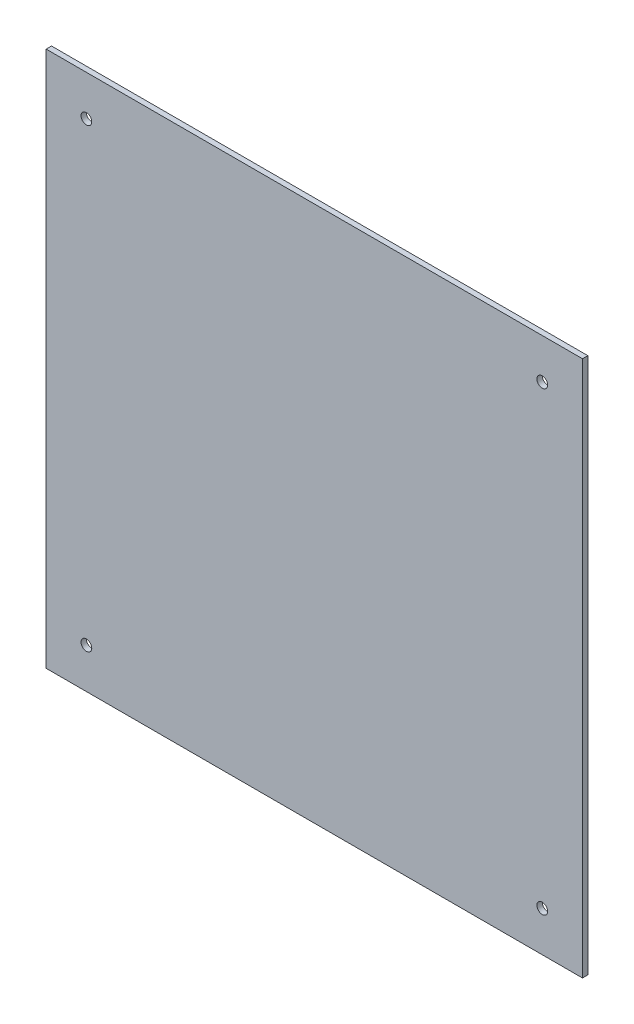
ISO-10303-21;
HEADER;
FILE_DESCRIPTION(('STEP AP214'),'2;1');
FILE_NAME('part.step','',(''),(''),'','','');
FILE_SCHEMA(('AUTOMOTIVE_DESIGN { 1 0 10303 214 1 1 1 1 }'));
ENDSEC;
DATA;
#1=APPLICATION_CONTEXT('core data for automotive mechanical design processes');
#2=APPLICATION_PROTOCOL_DEFINITION('international standard','automotive_design',2000,#1);
#3=PRODUCT_CONTEXT('',#1,'mechanical');
#4=PRODUCT('Part','Part','',(#3));
#5=PRODUCT_RELATED_PRODUCT_CATEGORY('part','',(#4));
#6=PRODUCT_DEFINITION_FORMATION('','',#4);
#7=PRODUCT_DEFINITION_CONTEXT('part definition',#1,'design');
#8=PRODUCT_DEFINITION('design','',#6,#7);
#9=PRODUCT_DEFINITION_SHAPE('','',#8);
#10=(LENGTH_UNIT() NAMED_UNIT(*) SI_UNIT(.MILLI.,.METRE.));
#11=(NAMED_UNIT(*) PLANE_ANGLE_UNIT() SI_UNIT($,.RADIAN.));
#12=(NAMED_UNIT(*) SI_UNIT($,.STERADIAN.) SOLID_ANGLE_UNIT());
#13=UNCERTAINTY_MEASURE_WITH_UNIT(LENGTH_MEASURE(1.E-05),#10,'distance_accuracy_value','');
#14=(GEOMETRIC_REPRESENTATION_CONTEXT(3) GLOBAL_UNCERTAINTY_ASSIGNED_CONTEXT((#13)) GLOBAL_UNIT_ASSIGNED_CONTEXT((#10,
#11,#12)) REPRESENTATION_CONTEXT('',''));
#15=CARTESIAN_POINT('',(0.,0.,0.));
#16=DIRECTION('',(0.,0.,1.));
#17=DIRECTION('',(1.,0.,0.));
#18=AXIS2_PLACEMENT_3D('',#15,#16,#17);
#19=CARTESIAN_POINT('',(0.,0.,2.));
#20=DIRECTION('',(0.,0.,-1.));
#21=DIRECTION('',(-1.,0.,0.));
#22=AXIS2_PLACEMENT_3D('',#19,#20,#21);
#23=PLANE('',#22);
#24=CARTESIAN_POINT('',(185.,-185.,2.));
#25=DIRECTION('',(0.,0.,1.));
#26=DIRECTION('',(1.,0.,0.));
#27=AXIS2_PLACEMENT_3D('',#24,#25,#26);
#28=CIRCLE('',#27,2.);
#29=CARTESIAN_POINT('',(187.,-185.,2.));
#30=VERTEX_POINT('',#29);
#31=EDGE_CURVE('E118',#30,#30,#28,.T.);
#32=ORIENTED_EDGE('',*,*,#31,.F.);
#33=EDGE_LOOP('',(#32));
#34=FACE_BOUND('',#33,.T.);
#35=CARTESIAN_POINT('',(15.,-15.,2.));
#36=DIRECTION('',(0.,0.,1.));
#37=DIRECTION('',(1.,0.,0.));
#38=AXIS2_PLACEMENT_3D('',#35,#36,#37);
#39=CIRCLE('',#38,2.00000000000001);
#40=CARTESIAN_POINT('',(17.,-15.,2.));
#41=VERTEX_POINT('',#40);
#42=EDGE_CURVE('E97',#41,#41,#39,.T.);
#43=ORIENTED_EDGE('',*,*,#42,.F.);
#44=EDGE_LOOP('',(#43));
#45=FACE_BOUND('',#44,.T.);
#46=DIRECTION('',(0.,-1.,0.));
#47=VECTOR('',#46,1.);
#48=CARTESIAN_POINT('',(0.,-200.,2.));
#49=LINE('',#48,#47);
#50=CARTESIAN_POINT('',(0.,0.,2.));
#51=VERTEX_POINT('',#50);
#52=CARTESIAN_POINT('',(0.,-200.,2.));
#53=VERTEX_POINT('',#52);
#54=EDGE_CURVE('E82',#51,#53,#49,.T.);
#55=ORIENTED_EDGE('',*,*,#54,.T.);
#56=DIRECTION('',(1.,0.,0.));
#57=VECTOR('',#56,1.);
#58=CARTESIAN_POINT('',(200.,-200.,2.));
#59=LINE('',#58,#57);
#60=CARTESIAN_POINT('',(200.,-200.,2.));
#61=VERTEX_POINT('',#60);
#62=EDGE_CURVE('E77',#53,#61,#59,.T.);
#63=ORIENTED_EDGE('',*,*,#62,.T.);
#64=DIRECTION('',(0.,1.,0.));
#65=VECTOR('',#64,1.);
#66=CARTESIAN_POINT('',(200.,0.,2.));
#67=LINE('',#66,#65);
#68=CARTESIAN_POINT('',(200.,0.,2.));
#69=VERTEX_POINT('',#68);
#70=EDGE_CURVE('E80',#61,#69,#67,.T.);
#71=ORIENTED_EDGE('',*,*,#70,.T.);
#72=DIRECTION('',(-1.,0.,0.));
#73=VECTOR('',#72,1.);
#74=CARTESIAN_POINT('',(0.,0.,2.));
#75=LINE('',#74,#73);
#76=EDGE_CURVE('E47',#69,#51,#75,.T.);
#77=ORIENTED_EDGE('',*,*,#76,.T.);
#78=EDGE_LOOP('',(#55,#63,#71,#77));
#79=FACE_BOUND('',#78,.T.);
#80=CARTESIAN_POINT('',(185.,-15.,2.));
#81=DIRECTION('',(0.,0.,1.));
#82=DIRECTION('',(1.,0.,0.));
#83=AXIS2_PLACEMENT_3D('',#80,#81,#82);
#84=CIRCLE('',#83,2.);
#85=CARTESIAN_POINT('',(187.,-15.,2.));
#86=VERTEX_POINT('',#85);
#87=EDGE_CURVE('E112',#86,#86,#84,.T.);
#88=ORIENTED_EDGE('',*,*,#87,.F.);
#89=EDGE_LOOP('',(#88));
#90=FACE_BOUND('',#89,.T.);
#91=CARTESIAN_POINT('',(15.,-185.,2.));
#92=DIRECTION('',(0.,0.,1.));
#93=DIRECTION('',(1.,0.,0.));
#94=AXIS2_PLACEMENT_3D('',#91,#92,#93);
#95=CIRCLE('',#94,2.);
#96=CARTESIAN_POINT('',(17.,-185.,2.));
#97=VERTEX_POINT('',#96);
#98=EDGE_CURVE('E124',#97,#97,#95,.T.);
#99=ORIENTED_EDGE('',*,*,#98,.F.);
#100=EDGE_LOOP('',(#99));
#101=FACE_BOUND('',#100,.T.);
#102=ADVANCED_FACE('F30',(#34,#45,#79,#90,#101),#23,.F.);
#103=CARTESIAN_POINT('',(0.,0.,0.));
#104=DIRECTION('',(0.,0.,-1.));
#105=DIRECTION('',(-1.,0.,0.));
#106=AXIS2_PLACEMENT_3D('',#103,#104,#105);
#107=PLANE('',#106);
#108=CARTESIAN_POINT('',(185.,-185.,0.));
#109=DIRECTION('',(0.,0.,1.));
#110=DIRECTION('',(1.,0.,0.));
#111=AXIS2_PLACEMENT_3D('',#108,#109,#110);
#112=CIRCLE('',#111,2.);
#113=CARTESIAN_POINT('',(187.,-185.,0.));
#114=VERTEX_POINT('',#113);
#115=EDGE_CURVE('E121',#114,#114,#112,.T.);
#116=ORIENTED_EDGE('',*,*,#115,.T.);
#117=EDGE_LOOP('',(#116));
#118=FACE_BOUND('',#117,.T.);
#119=CARTESIAN_POINT('',(15.,-15.,0.));
#120=DIRECTION('',(0.,0.,1.));
#121=DIRECTION('',(1.,0.,0.));
#122=AXIS2_PLACEMENT_3D('',#119,#120,#121);
#123=CIRCLE('',#122,2.00000000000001);
#124=CARTESIAN_POINT('',(17.,-15.,0.));
#125=VERTEX_POINT('',#124);
#126=EDGE_CURVE('E109',#125,#125,#123,.T.);
#127=ORIENTED_EDGE('',*,*,#126,.T.);
#128=EDGE_LOOP('',(#127));
#129=FACE_BOUND('',#128,.T.);
#130=DIRECTION('',(0.,-1.,0.));
#131=VECTOR('',#130,1.);
#132=CARTESIAN_POINT('',(0.,-200.,0.));
#133=LINE('',#132,#131);
#134=CARTESIAN_POINT('',(0.,0.,0.));
#135=VERTEX_POINT('',#134);
#136=CARTESIAN_POINT('',(0.,-200.,0.));
#137=VERTEX_POINT('',#136);
#138=EDGE_CURVE('E94',#135,#137,#133,.T.);
#139=ORIENTED_EDGE('',*,*,#138,.F.);
#140=DIRECTION('',(-1.,0.,0.));
#141=VECTOR('',#140,1.);
#142=CARTESIAN_POINT('',(0.,0.,0.));
#143=LINE('',#142,#141);
#144=CARTESIAN_POINT('',(200.,0.,0.));
#145=VERTEX_POINT('',#144);
#146=EDGE_CURVE('E70',#145,#135,#143,.T.);
#147=ORIENTED_EDGE('',*,*,#146,.F.);
#148=DIRECTION('',(0.,1.,0.));
#149=VECTOR('',#148,1.);
#150=CARTESIAN_POINT('',(200.,0.,0.));
#151=LINE('',#150,#149);
#152=CARTESIAN_POINT('',(200.,-200.,0.));
#153=VERTEX_POINT('',#152);
#154=EDGE_CURVE('E64',#153,#145,#151,.T.);
#155=ORIENTED_EDGE('',*,*,#154,.F.);
#156=DIRECTION('',(1.,0.,0.));
#157=VECTOR('',#156,1.);
#158=CARTESIAN_POINT('',(200.,-200.,0.));
#159=LINE('',#158,#157);
#160=EDGE_CURVE('E86',#137,#153,#159,.T.);
#161=ORIENTED_EDGE('',*,*,#160,.F.);
#162=EDGE_LOOP('',(#139,#147,#155,#161));
#163=FACE_BOUND('',#162,.T.);
#164=CARTESIAN_POINT('',(185.,-15.,0.));
#165=DIRECTION('',(0.,0.,1.));
#166=DIRECTION('',(1.,0.,0.));
#167=AXIS2_PLACEMENT_3D('',#164,#165,#166);
#168=CIRCLE('',#167,2.);
#169=CARTESIAN_POINT('',(187.,-15.,0.));
#170=VERTEX_POINT('',#169);
#171=EDGE_CURVE('E115',#170,#170,#168,.T.);
#172=ORIENTED_EDGE('',*,*,#171,.T.);
#173=EDGE_LOOP('',(#172));
#174=FACE_BOUND('',#173,.T.);
#175=CARTESIAN_POINT('',(15.,-185.,0.));
#176=DIRECTION('',(0.,0.,1.));
#177=DIRECTION('',(1.,0.,0.));
#178=AXIS2_PLACEMENT_3D('',#175,#176,#177);
#179=CIRCLE('',#178,2.);
#180=CARTESIAN_POINT('',(17.,-185.,0.));
#181=VERTEX_POINT('',#180);
#182=EDGE_CURVE('E127',#181,#181,#179,.T.);
#183=ORIENTED_EDGE('',*,*,#182,.T.);
#184=EDGE_LOOP('',(#183));
#185=FACE_BOUND('',#184,.T.);
#186=ADVANCED_FACE('F105',(#118,#129,#163,#174,#185),#107,.T.);
#187=CARTESIAN_POINT('',(0.,-200.,2.));
#188=DIRECTION('',(1.,0.,0.));
#189=DIRECTION('',(0.,0.,-1.));
#190=AXIS2_PLACEMENT_3D('',#187,#188,#189);
#191=PLANE('',#190);
#192=ORIENTED_EDGE('',*,*,#138,.T.);
#193=DIRECTION('',(0.,0.,-1.));
#194=VECTOR('',#193,1.);
#195=CARTESIAN_POINT('',(0.,-200.,2.));
#196=LINE('',#195,#194);
#197=EDGE_CURVE('E11',#53,#137,#196,.T.);
#198=ORIENTED_EDGE('',*,*,#197,.F.);
#199=ORIENTED_EDGE('',*,*,#54,.F.);
#200=DIRECTION('',(0.,0.,-1.));
#201=VECTOR('',#200,1.);
#202=CARTESIAN_POINT('',(0.,0.,2.));
#203=LINE('',#202,#201);
#204=EDGE_CURVE('E90',#51,#135,#203,.T.);
#205=ORIENTED_EDGE('',*,*,#204,.T.);
#206=EDGE_LOOP('',(#192,#198,#199,#205));
#207=FACE_BOUND('',#206,.T.);
#208=ADVANCED_FACE('F32',(#207),#191,.F.);
#209=CARTESIAN_POINT('',(200.,-200.,2.));
#210=DIRECTION('',(0.,1.,0.));
#211=DIRECTION('',(-1.,0.,0.));
#212=AXIS2_PLACEMENT_3D('',#209,#210,#211);
#213=PLANE('',#212);
#214=ORIENTED_EDGE('',*,*,#160,.T.);
#215=DIRECTION('',(0.,0.,-1.));
#216=VECTOR('',#215,1.);
#217=CARTESIAN_POINT('',(200.,-200.,2.));
#218=LINE('',#217,#216);
#219=EDGE_CURVE('E39',#61,#153,#218,.T.);
#220=ORIENTED_EDGE('',*,*,#219,.F.);
#221=ORIENTED_EDGE('',*,*,#62,.F.);
#222=ORIENTED_EDGE('',*,*,#197,.T.);
#223=EDGE_LOOP('',(#214,#220,#221,#222));
#224=FACE_BOUND('',#223,.T.);
#225=ADVANCED_FACE('F85',(#224),#213,.F.);
#226=CARTESIAN_POINT('',(200.,0.,2.));
#227=DIRECTION('',(-1.,0.,0.));
#228=DIRECTION('',(0.,-1.,0.));
#229=AXIS2_PLACEMENT_3D('',#226,#227,#228);
#230=PLANE('',#229);
#231=ORIENTED_EDGE('',*,*,#154,.T.);
#232=DIRECTION('',(0.,0.,-1.));
#233=VECTOR('',#232,1.);
#234=CARTESIAN_POINT('',(200.,0.,2.));
#235=LINE('',#234,#233);
#236=EDGE_CURVE('E87',#69,#145,#235,.T.);
#237=ORIENTED_EDGE('',*,*,#236,.F.);
#238=ORIENTED_EDGE('',*,*,#70,.F.);
#239=ORIENTED_EDGE('',*,*,#219,.T.);
#240=EDGE_LOOP('',(#231,#237,#238,#239));
#241=FACE_BOUND('',#240,.T.);
#242=ADVANCED_FACE('F88',(#241),#230,.F.);
#243=CARTESIAN_POINT('',(0.,0.,2.));
#244=DIRECTION('',(0.,-1.,0.));
#245=DIRECTION('',(0.,0.,-1.));
#246=AXIS2_PLACEMENT_3D('',#243,#244,#245);
#247=PLANE('',#246);
#248=ORIENTED_EDGE('',*,*,#146,.T.);
#249=ORIENTED_EDGE('',*,*,#204,.F.);
#250=ORIENTED_EDGE('',*,*,#76,.F.);
#251=ORIENTED_EDGE('',*,*,#236,.T.);
#252=EDGE_LOOP('',(#248,#249,#250,#251));
#253=FACE_BOUND('',#252,.T.);
#254=ADVANCED_FACE('F102',(#253),#247,.F.);
#255=CARTESIAN_POINT('',(15.,-15.,2.));
#256=DIRECTION('',(0.,0.,-1.));
#257=DIRECTION('',(-1.,0.,0.));
#258=AXIS2_PLACEMENT_3D('',#255,#256,#257);
#259=CYLINDRICAL_SURFACE('',#258,2.00000000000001);
#260=ORIENTED_EDGE('',*,*,#42,.T.);
#261=EDGE_LOOP('',(#260));
#262=FACE_BOUND('',#261,.T.);
#263=ORIENTED_EDGE('',*,*,#126,.F.);
#264=EDGE_LOOP('',(#263));
#265=FACE_BOUND('',#264,.T.);
#266=ADVANCED_FACE('F147',(#262,#265),#259,.F.);
#267=CARTESIAN_POINT('',(185.,-15.,2.));
#268=DIRECTION('',(0.,0.,-1.));
#269=DIRECTION('',(-1.,0.,0.));
#270=AXIS2_PLACEMENT_3D('',#267,#268,#269);
#271=CYLINDRICAL_SURFACE('',#270,2.);
#272=ORIENTED_EDGE('',*,*,#87,.T.);
#273=EDGE_LOOP('',(#272));
#274=FACE_BOUND('',#273,.T.);
#275=ORIENTED_EDGE('',*,*,#171,.F.);
#276=EDGE_LOOP('',(#275));
#277=FACE_BOUND('',#276,.T.);
#278=ADVANCED_FACE('F193',(#274,#277),#271,.F.);
#279=CARTESIAN_POINT('',(185.,-185.,2.));
#280=DIRECTION('',(0.,0.,-1.));
#281=DIRECTION('',(-1.,0.,0.));
#282=AXIS2_PLACEMENT_3D('',#279,#280,#281);
#283=CYLINDRICAL_SURFACE('',#282,2.);
#284=ORIENTED_EDGE('',*,*,#31,.T.);
#285=EDGE_LOOP('',(#284));
#286=FACE_BOUND('',#285,.T.);
#287=ORIENTED_EDGE('',*,*,#115,.F.);
#288=EDGE_LOOP('',(#287));
#289=FACE_BOUND('',#288,.T.);
#290=ADVANCED_FACE('F201',(#286,#289),#283,.F.);
#291=CARTESIAN_POINT('',(15.,-185.,2.));
#292=DIRECTION('',(0.,0.,-1.));
#293=DIRECTION('',(-1.,0.,0.));
#294=AXIS2_PLACEMENT_3D('',#291,#292,#293);
#295=CYLINDRICAL_SURFACE('',#294,2.);
#296=ORIENTED_EDGE('',*,*,#98,.T.);
#297=EDGE_LOOP('',(#296));
#298=FACE_BOUND('',#297,.T.);
#299=ORIENTED_EDGE('',*,*,#182,.F.);
#300=EDGE_LOOP('',(#299));
#301=FACE_BOUND('',#300,.T.);
#302=ADVANCED_FACE('F133',(#298,#301),#295,.F.);
#303=CLOSED_SHELL('',(#102,#186,#208,#225,#242,#254,#266,#278,#290,#302));
#304=MANIFOLD_SOLID_BREP('B2',#303);
#305=ADVANCED_BREP_SHAPE_REPRESENTATION('',(#18,#304),#14);
#306=SHAPE_DEFINITION_REPRESENTATION(#9,#305);
ENDSEC;
END-ISO-10303-21;
